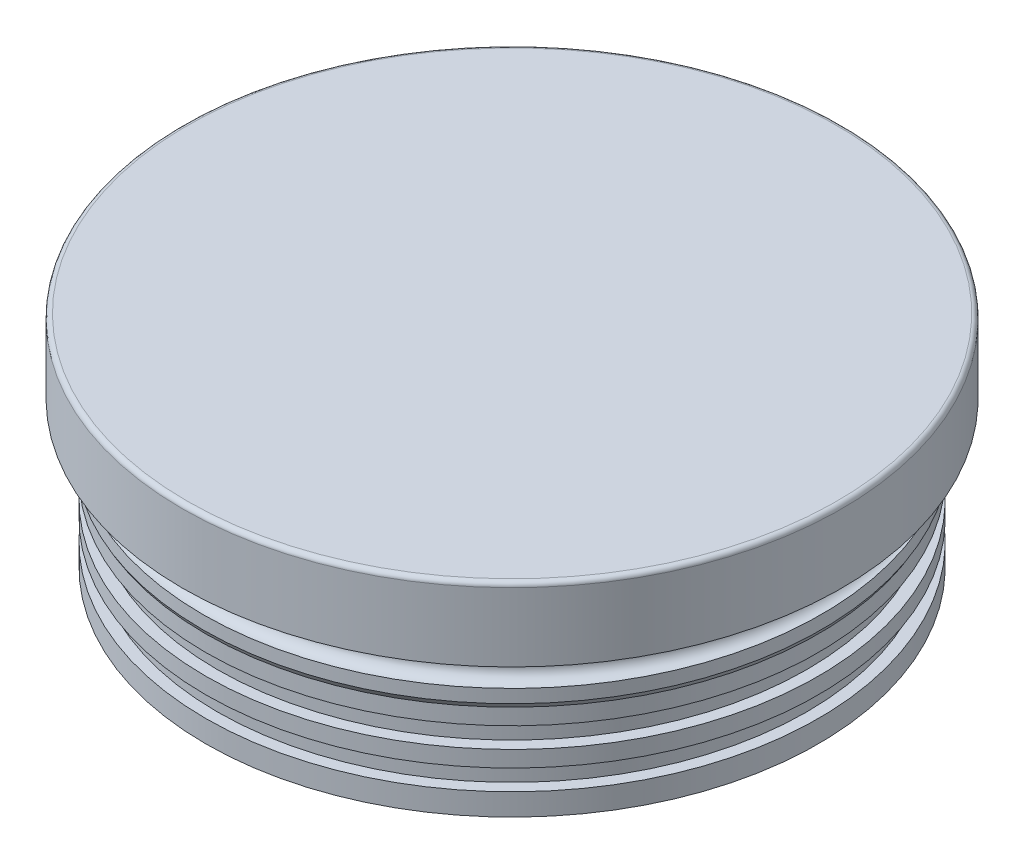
from build123d import *

# Parameters (mm, degrees)
SKETCH1_R                = 57.15
F_4INROD_DEPTH           = 38.1
CUT_EXTRUDE11_REACH      = 87.725
CUT_EXTRUDE11_END_RADIUS = 0.79375
SKETCH21_R               = 0.79375
FILLET2_R                = 0.7874
CHAMFER2_SIZE            = 3.18262
CHAMFER2_SIZE2           = 1.837486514


with BuildPart() as part:
    # Sketch1 → 4inRod (new body)
    with BuildSketch(Plane(origin=(0, 0, 0), x_dir=(1, 0, 0), z_dir=(0, 1, 0))):
        with Locations(Location((0, 0, 0), (0, 0, 270))):
            Circle(SKETCH1_R)
    extrude(amount=-F_4INROD_DEPTH)

    # Sketch9 → Cut-Revolve2 (revolve, cut)
    with BuildSketch(Plane.XY, mode=Mode.PRIVATE) as cut_revolve2_sk:
        with BuildLine():
            Line((-53.1114, -24.384), (-51.1175, -24.384))
            Line((-51.1175, -24.384), (-51.1175, -27.94))
            Line((-51.1175, -27.94), (-53.1114, -27.94))
            Line((-53.1114, -27.94), (-53.1114, -30.734))
            Line((-53.1114, -30.734), (-51.1175, -30.734))
            Line((-51.1175, -30.734), (-51.1175, -34.29))
            Line((-51.1175, -34.29), (-53.1114, -34.29))
            Line((-53.1114, -34.29), (-53.1114, -38.1))
            Line((-53.1114, -38.1), (-57.15, -38.1))
            Line((-57.15, -38.1), (-57.15, -12.7))
            Line((-57.15, -12.7), (-53.6194, -12.7))
            Line((-53.6194, -12.7), (-53.6194, -14.605))
            ThreePointArc((-53.6194, -14.605), (-51.7144, -16.51), (-53.6194, -18.415))
            Line((-53.6194, -18.415), (-53.6194, -20.71011819))
            Line((-53.6194, -20.71011819), (-53.1114, -21.59))
            Line((-53.1114, -21.59), (-53.1114, -24.384))
        make_face()
    revolve(cut_revolve2_sk.sketch.rotate(Axis((0, 0, 0), (0, -1, 0)), 270), axis=Axis((0, 0, 0), (0, -1, 0)), mode=Mode.SUBTRACT)

    # Sketch19 → Cut-Revolve3 (revolve, cut)
    with BuildSketch(Plane.XY, mode=Mode.PRIVATE) as cut_revolve3_sk:
        with BuildLine():
            Line((0, -38.1), (-47.625, -38.1))
            Line((-47.625, -38.1), (-47.625, -22.225))
            ThreePointArc((-47.625, -22.225), (-43.905256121, -13.244743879), (-34.925, -9.525))
            Line((-34.925, -9.525), (0, -9.525))
            Line((0, -9.525), (0, -38.1))
        make_face()
    revolve(cut_revolve3_sk.sketch.rotate(Axis((0, -38.1, 0), (0, -1, 0)), 270), axis=Axis((0, -38.1, 0), (0, -1, 0)), mode=Mode.SUBTRACT)

    # Sketch20 → Cut-Revolve4 (revolve, cut)
    with BuildSketch(Plane.XY):
        Polygon((-57.1754, -6.35), (-31.298466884, -6.35), (-31.7754, -5.55625), (-37.564526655, -5.55625), (-38.1254, -4.6228), (-53.3654, -4.6228), (-53.3654, -1.905), (-57.1754, -1.905), align=None)
    revolve(axis=Axis((-57.1754, -6.35, 0), (-1, 0, 0)), mode=Mode.SUBTRACT)

    # Cut-Extrude11: up to this cylinder (the profile starts outside it)
    cut_extrude11_end = Plane(origin=(-34.925, -6.35, 0), z_dir=(1, 0, 0)) * Cylinder(CUT_EXTRUDE11_END_RADIUS, 178.0375, mode=Mode.PRIVATE)
    # Sketch21 → Cut-Extrude11 (cut, up to the surface)
    with BuildSketch(Plane.XZ.offset(9.525), mode=Mode.PRIVATE) as cut_extrude11_sk1:
        with Locations(Location((-34.925, 0, 0), (0, 0, 270))):
            Circle(SKETCH21_R)
    cut_extrude11_tool1 = extrude(cut_extrude11_sk1.sketch, amount=-CUT_EXTRUDE11_REACH, mode=Mode.PRIVATE) - cut_extrude11_end
    add(cut_extrude11_tool1.solids().sort_by_distance((-34.925, -9.525, 0))[0], mode=Mode.SUBTRACT)

    # Fillet2
    fillet2_edges = [part.edges().sort_by_distance(p)[0] for p in [
        (0, 0, -57.15),
    ]]
    fillet(fillet2_edges, radius=FILLET2_R)

    # Chamfer2
    chamfer2_edges = [part.edges().sort_by_distance(p)[0] for p in [
        (0, -38.1, -47.625),
    ]]
    chamfer2_side = [part.faces().sort_by_distance(p)[0] for p in [
        (0, -30.1625, -47.625),
    ]]
    chamfer(chamfer2_edges, length=CHAMFER2_SIZE, length2=CHAMFER2_SIZE2, reference=chamfer2_side[0])


solid = part.part
